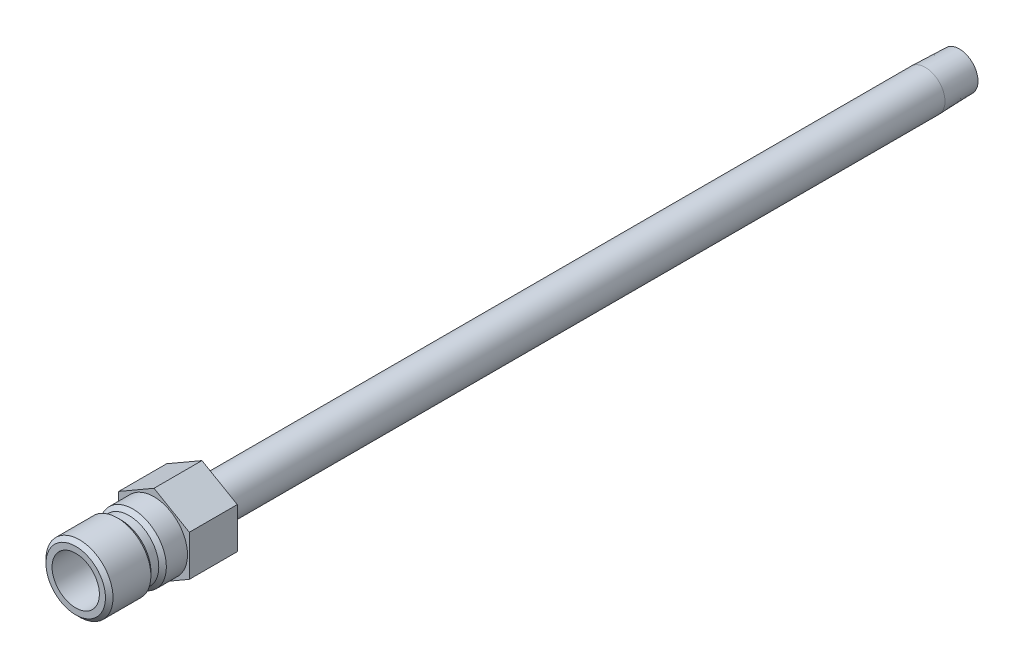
ISO-10303-21;
HEADER;
FILE_DESCRIPTION(('STEP AP214'),'2;1');
FILE_NAME('part.step','',(''),(''),'','','');
FILE_SCHEMA(('AUTOMOTIVE_DESIGN { 1 0 10303 214 1 1 1 1 }'));
ENDSEC;
DATA;
#1=APPLICATION_CONTEXT('core data for automotive mechanical design processes');
#2=APPLICATION_PROTOCOL_DEFINITION('international standard','automotive_design',2000,#1);
#3=PRODUCT_CONTEXT('',#1,'mechanical');
#4=PRODUCT('Part','Part','',(#3));
#5=PRODUCT_RELATED_PRODUCT_CATEGORY('part','',(#4));
#6=PRODUCT_DEFINITION_FORMATION('','',#4);
#7=PRODUCT_DEFINITION_CONTEXT('part definition',#1,'design');
#8=PRODUCT_DEFINITION('design','',#6,#7);
#9=PRODUCT_DEFINITION_SHAPE('','',#8);
#10=(LENGTH_UNIT() NAMED_UNIT(*) SI_UNIT(.MILLI.,.METRE.));
#11=(NAMED_UNIT(*) PLANE_ANGLE_UNIT() SI_UNIT($,.RADIAN.));
#12=(NAMED_UNIT(*) SI_UNIT($,.STERADIAN.) SOLID_ANGLE_UNIT());
#13=UNCERTAINTY_MEASURE_WITH_UNIT(LENGTH_MEASURE(1.E-05),#10,'distance_accuracy_value','');
#14=(GEOMETRIC_REPRESENTATION_CONTEXT(3) GLOBAL_UNCERTAINTY_ASSIGNED_CONTEXT((#13)) GLOBAL_UNIT_ASSIGNED_CONTEXT((#10,
#11,#12)) REPRESENTATION_CONTEXT('',''));
#15=CARTESIAN_POINT('',(0.,0.,0.));
#16=DIRECTION('',(0.,0.,1.));
#17=DIRECTION('',(1.,0.,0.));
#18=AXIS2_PLACEMENT_3D('',#15,#16,#17);
#19=CARTESIAN_POINT('',(0.,0.,-9.652));
#20=DIRECTION('',(0.,0.,-1.));
#21=DIRECTION('',(0.,1.,0.));
#22=AXIS2_PLACEMENT_3D('',#19,#20,#21);
#23=CYLINDRICAL_SURFACE('',#22,2.65430000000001);
#24=CARTESIAN_POINT('',(0.,0.,2.43505017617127));
#25=DIRECTION('',(0.,0.,-1.));
#26=DIRECTION('',(0.,1.,0.));
#27=AXIS2_PLACEMENT_3D('',#24,#25,#26);
#28=CIRCLE('',#27,2.6543);
#29=CARTESIAN_POINT('',(0.,2.6543,2.43505017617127));
#30=VERTEX_POINT('',#29);
#31=EDGE_CURVE('E41',#30,#30,#28,.T.);
#32=ORIENTED_EDGE('',*,*,#31,.F.);
#33=EDGE_LOOP('',(#32));
#34=FACE_BOUND('',#33,.T.);
#35=CARTESIAN_POINT('',(0.,0.,-162.052));
#36=DIRECTION('',(0.,0.,-1.));
#37=DIRECTION('',(0.,1.,0.));
#38=AXIS2_PLACEMENT_3D('',#35,#36,#37);
#39=CIRCLE('',#38,2.65430000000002);
#40=CARTESIAN_POINT('',(0.,2.65430000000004,-162.052));
#41=VERTEX_POINT('',#40);
#42=EDGE_CURVE('E137',#41,#41,#39,.T.);
#43=ORIENTED_EDGE('',*,*,#42,.T.);
#44=EDGE_LOOP('',(#43));
#45=FACE_BOUND('',#44,.T.);
#46=ADVANCED_FACE('F33',(#34,#45),#23,.F.);
#47=CARTESIAN_POINT('',(0.,0.,3.556));
#48=DIRECTION('',(0.,0.,1.));
#49=DIRECTION('',(0.,-1.,0.));
#50=AXIS2_PLACEMENT_3D('',#47,#48,#49);
#51=CONICAL_SURFACE('',#50,4.7625,1.08210413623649);
#52=ORIENTED_EDGE('',*,*,#31,.T.);
#53=EDGE_LOOP('',(#52));
#54=FACE_BOUND('',#53,.T.);
#55=CARTESIAN_POINT('',(0.,0.,3.556));
#56=DIRECTION('',(0.,0.,-1.));
#57=DIRECTION('',(0.,1.,0.));
#58=AXIS2_PLACEMENT_3D('',#55,#56,#57);
#59=CIRCLE('',#58,4.7625);
#60=CARTESIAN_POINT('',(0.,4.7625,3.556));
#61=VERTEX_POINT('',#60);
#62=EDGE_CURVE('E175',#61,#61,#59,.T.);
#63=ORIENTED_EDGE('',*,*,#62,.F.);
#64=EDGE_LOOP('',(#63));
#65=FACE_BOUND('',#64,.T.);
#66=ADVANCED_FACE('F180',(#54,#65),#51,.F.);
#67=CARTESIAN_POINT('',(0.,0.,-9.652));
#68=DIRECTION('',(0.,0.,-1.));
#69=DIRECTION('',(0.,1.,0.));
#70=AXIS2_PLACEMENT_3D('',#67,#68,#69);
#71=CYLINDRICAL_SURFACE('',#70,4.7625);
#72=ORIENTED_EDGE('',*,*,#62,.T.);
#73=EDGE_LOOP('',(#72));
#74=FACE_BOUND('',#73,.T.);
#75=CARTESIAN_POINT('',(0.,0.,15.748));
#76=DIRECTION('',(0.,0.,-1.));
#77=DIRECTION('',(0.,1.,0.));
#78=AXIS2_PLACEMENT_3D('',#75,#76,#77);
#79=CIRCLE('',#78,4.7625);
#80=CARTESIAN_POINT('',(0.,4.7625,15.748));
#81=VERTEX_POINT('',#80);
#82=EDGE_CURVE('E172',#81,#81,#79,.T.);
#83=ORIENTED_EDGE('',*,*,#82,.F.);
#84=EDGE_LOOP('',(#83));
#85=FACE_BOUND('',#84,.T.);
#86=ADVANCED_FACE('F237',(#74,#85),#71,.F.);
#87=CARTESIAN_POINT('',(0.,4.7625,15.748));
#88=DIRECTION('',(0.,0.,1.));
#89=DIRECTION('',(0.,-1.,0.));
#90=AXIS2_PLACEMENT_3D('',#87,#88,#89);
#91=PLANE('',#90);
#92=ORIENTED_EDGE('',*,*,#82,.T.);
#93=EDGE_LOOP('',(#92));
#94=FACE_BOUND('',#93,.T.);
#95=CARTESIAN_POINT('',(0.,0.,15.748));
#96=DIRECTION('',(0.,0.,-1.));
#97=DIRECTION('',(0.,1.,0.));
#98=AXIS2_PLACEMENT_3D('',#95,#96,#97);
#99=CIRCLE('',#98,5.9817);
#100=CARTESIAN_POINT('',(0.,5.9817,15.748));
#101=VERTEX_POINT('',#100);
#102=EDGE_CURVE('E169',#101,#101,#99,.T.);
#103=ORIENTED_EDGE('',*,*,#102,.F.);
#104=EDGE_LOOP('',(#103));
#105=FACE_BOUND('',#104,.T.);
#106=ADVANCED_FACE('F233',(#94,#105),#91,.T.);
#107=CARTESIAN_POINT('',(0.,0.,14.986));
#108=DIRECTION('',(0.,0.,-1.));
#109=DIRECTION('',(0.,1.,0.));
#110=AXIS2_PLACEMENT_3D('',#107,#108,#109);
#111=CONICAL_SURFACE('',#110,6.7437,0.785398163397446);
#112=ORIENTED_EDGE('',*,*,#102,.T.);
#113=EDGE_LOOP('',(#112));
#114=FACE_BOUND('',#113,.T.);
#115=CARTESIAN_POINT('',(0.,0.,14.986));
#116=DIRECTION('',(0.,0.,-1.));
#117=DIRECTION('',(0.,1.,0.));
#118=AXIS2_PLACEMENT_3D('',#115,#116,#117);
#119=CIRCLE('',#118,6.7437);
#120=CARTESIAN_POINT('',(0.,6.7437,14.986));
#121=VERTEX_POINT('',#120);
#122=EDGE_CURVE('E166',#121,#121,#119,.T.);
#123=ORIENTED_EDGE('',*,*,#122,.F.);
#124=EDGE_LOOP('',(#123));
#125=FACE_BOUND('',#124,.T.);
#126=ADVANCED_FACE('F229',(#114,#125),#111,.T.);
#127=CARTESIAN_POINT('',(0.,0.,-9.652));
#128=DIRECTION('',(0.,0.,-1.));
#129=DIRECTION('',(0.,1.,0.));
#130=AXIS2_PLACEMENT_3D('',#127,#128,#129);
#131=CYLINDRICAL_SURFACE('',#130,6.7437);
#132=ORIENTED_EDGE('',*,*,#122,.T.);
#133=EDGE_LOOP('',(#132));
#134=FACE_BOUND('',#133,.T.);
#135=CARTESIAN_POINT('',(0.,0.,7.366));
#136=DIRECTION('',(0.,0.,-1.));
#137=DIRECTION('',(0.,1.,0.));
#138=AXIS2_PLACEMENT_3D('',#135,#136,#137);
#139=CIRCLE('',#138,6.7437);
#140=CARTESIAN_POINT('',(0.,6.7437,7.366));
#141=VERTEX_POINT('',#140);
#142=EDGE_CURVE('E163',#141,#141,#139,.T.);
#143=ORIENTED_EDGE('',*,*,#142,.F.);
#144=EDGE_LOOP('',(#143));
#145=FACE_BOUND('',#144,.T.);
#146=ADVANCED_FACE('F225',(#134,#145),#131,.T.);
#147=CARTESIAN_POINT('',(0.,0.,6.604));
#148=DIRECTION('',(0.,0.,1.));
#149=DIRECTION('',(0.,-1.,0.));
#150=AXIS2_PLACEMENT_3D('',#147,#148,#149);
#151=CONICAL_SURFACE('',#150,5.9817,0.785398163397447);
#152=ORIENTED_EDGE('',*,*,#142,.T.);
#153=EDGE_LOOP('',(#152));
#154=FACE_BOUND('',#153,.T.);
#155=CARTESIAN_POINT('',(0.,0.,6.604));
#156=DIRECTION('',(0.,0.,-1.));
#157=DIRECTION('',(0.,1.,0.));
#158=AXIS2_PLACEMENT_3D('',#155,#156,#157);
#159=CIRCLE('',#158,5.9817);
#160=CARTESIAN_POINT('',(0.,5.9817,6.604));
#161=VERTEX_POINT('',#160);
#162=EDGE_CURVE('E160',#161,#161,#159,.T.);
#163=ORIENTED_EDGE('',*,*,#162,.F.);
#164=EDGE_LOOP('',(#163));
#165=FACE_BOUND('',#164,.T.);
#166=ADVANCED_FACE('F221',(#154,#165),#151,.T.);
#167=CARTESIAN_POINT('',(0.,0.,-9.652));
#168=DIRECTION('',(0.,0.,-1.));
#169=DIRECTION('',(0.,1.,0.));
#170=AXIS2_PLACEMENT_3D('',#167,#168,#169);
#171=CYLINDRICAL_SURFACE('',#170,5.9817);
#172=ORIENTED_EDGE('',*,*,#162,.T.);
#173=EDGE_LOOP('',(#172));
#174=FACE_BOUND('',#173,.T.);
#175=CARTESIAN_POINT('',(0.,0.,5.0165));
#176=DIRECTION('',(0.,0.,-1.));
#177=DIRECTION('',(0.,1.,0.));
#178=AXIS2_PLACEMENT_3D('',#175,#176,#177);
#179=CIRCLE('',#178,5.9817);
#180=CARTESIAN_POINT('',(0.,5.9817,5.0165));
#181=VERTEX_POINT('',#180);
#182=EDGE_CURVE('E157',#181,#181,#179,.T.);
#183=ORIENTED_EDGE('',*,*,#182,.F.);
#184=EDGE_LOOP('',(#183));
#185=FACE_BOUND('',#184,.T.);
#186=ADVANCED_FACE('F217',(#174,#185),#171,.T.);
#187=CARTESIAN_POINT('',(0.,0.,4.25449999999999));
#188=DIRECTION('',(0.,0.,-1.));
#189=DIRECTION('',(0.,1.,0.));
#190=AXIS2_PLACEMENT_3D('',#187,#188,#189);
#191=CONICAL_SURFACE('',#190,6.7437,0.785398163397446);
#192=ORIENTED_EDGE('',*,*,#182,.T.);
#193=EDGE_LOOP('',(#192));
#194=FACE_BOUND('',#193,.T.);
#195=CARTESIAN_POINT('',(0.,0.,4.25449999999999));
#196=DIRECTION('',(0.,0.,-1.));
#197=DIRECTION('',(0.,1.,0.));
#198=AXIS2_PLACEMENT_3D('',#195,#196,#197);
#199=CIRCLE('',#198,6.7437);
#200=CARTESIAN_POINT('',(0.,6.7437,4.25449999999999));
#201=VERTEX_POINT('',#200);
#202=EDGE_CURVE('E154',#201,#201,#199,.T.);
#203=ORIENTED_EDGE('',*,*,#202,.F.);
#204=EDGE_LOOP('',(#203));
#205=FACE_BOUND('',#204,.T.);
#206=ADVANCED_FACE('F213',(#194,#205),#191,.T.);
#207=CARTESIAN_POINT('',(0.,0.,-9.652));
#208=DIRECTION('',(0.,0.,-1.));
#209=DIRECTION('',(0.,1.,0.));
#210=AXIS2_PLACEMENT_3D('',#207,#208,#209);
#211=CYLINDRICAL_SURFACE('',#210,6.7437);
#212=CARTESIAN_POINT('',(0.,0.,0.));
#213=DIRECTION('',(0.,0.,1.));
#214=DIRECTION('',(1.,0.,0.));
#215=AXIS2_PLACEMENT_3D('',#212,#213,#214);
#216=CIRCLE('',#215,6.7437);
#217=CARTESIAN_POINT('',(6.7437,0.,0.));
#218=VERTEX_POINT('',#217);
#219=EDGE_CURVE('E11',#218,#218,#216,.F.);
#220=ORIENTED_EDGE('',*,*,#219,.F.);
#221=EDGE_LOOP('',(#220));
#222=FACE_BOUND('',#221,.T.);
#223=ORIENTED_EDGE('',*,*,#202,.T.);
#224=EDGE_LOOP('',(#223));
#225=FACE_BOUND('',#224,.T.);
#226=ADVANCED_FACE('F209',(#222,#225),#211,.T.);
#227=CARTESIAN_POINT('',(0.,6.7437,-9.652));
#228=DIRECTION('',(0.,0.,-1.));
#229=DIRECTION('',(0.,1.,0.));
#230=AXIS2_PLACEMENT_3D('',#227,#228,#229);
#231=PLANE('',#230);
#232=CARTESIAN_POINT('',(0.,0.,-9.652));
#233=DIRECTION('',(0.,0.,-1.));
#234=DIRECTION('',(0.,1.,0.));
#235=AXIS2_PLACEMENT_3D('',#232,#233,#234);
#236=CIRCLE('',#235,3.96875);
#237=CARTESIAN_POINT('',(0.,3.96875,-9.652));
#238=VERTEX_POINT('',#237);
#239=EDGE_CURVE('E151',#238,#238,#236,.T.);
#240=ORIENTED_EDGE('',*,*,#239,.F.);
#241=EDGE_LOOP('',(#240));
#242=FACE_BOUND('',#241,.T.);
#243=DIRECTION('',(-0.866025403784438,-0.5,0.));
#244=VECTOR('',#243,1.);
#245=CARTESIAN_POINT('',(0.,8.21223022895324,-9.652));
#246=LINE('',#245,#244);
#247=CARTESIAN_POINT('',(0.,8.21223022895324,-9.652));
#248=VERTEX_POINT('',#247);
#249=CARTESIAN_POINT('',(-7.112,4.10611511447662,-9.652));
#250=VERTEX_POINT('',#249);
#251=EDGE_CURVE('E135',#248,#250,#246,.T.);
#252=ORIENTED_EDGE('',*,*,#251,.F.);
#253=DIRECTION('',(-0.866025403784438,0.5,0.));
#254=VECTOR('',#253,1.);
#255=CARTESIAN_POINT('',(7.112,4.10611511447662,-9.652));
#256=LINE('',#255,#254);
#257=CARTESIAN_POINT('',(7.112,4.10611511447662,-9.652));
#258=VERTEX_POINT('',#257);
#259=EDGE_CURVE('E110',#258,#248,#256,.T.);
#260=ORIENTED_EDGE('',*,*,#259,.F.);
#261=DIRECTION('',(0.,1.,0.));
#262=VECTOR('',#261,1.);
#263=CARTESIAN_POINT('',(7.112,-4.10611511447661,-9.652));
#264=LINE('',#263,#262);
#265=CARTESIAN_POINT('',(7.112,-4.10611511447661,-9.652));
#266=VERTEX_POINT('',#265);
#267=EDGE_CURVE('E95',#266,#258,#264,.T.);
#268=ORIENTED_EDGE('',*,*,#267,.F.);
#269=DIRECTION('',(0.866025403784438,0.5,0.));
#270=VECTOR('',#269,1.);
#271=CARTESIAN_POINT('',(0.,-8.21223022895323,-9.652));
#272=LINE('',#271,#270);
#273=CARTESIAN_POINT('',(0.,-8.21223022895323,-9.652));
#274=VERTEX_POINT('',#273);
#275=EDGE_CURVE('E108',#274,#266,#272,.T.);
#276=ORIENTED_EDGE('',*,*,#275,.F.);
#277=DIRECTION('',(0.866025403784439,-0.5,0.));
#278=VECTOR('',#277,1.);
#279=CARTESIAN_POINT('',(-7.112,-4.10611511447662,-9.652));
#280=LINE('',#279,#278);
#281=CARTESIAN_POINT('',(-7.112,-4.10611511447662,-9.652));
#282=VERTEX_POINT('',#281);
#283=EDGE_CURVE('E113',#282,#274,#280,.T.);
#284=ORIENTED_EDGE('',*,*,#283,.F.);
#285=DIRECTION('',(0.,-1.,0.));
#286=VECTOR('',#285,1.);
#287=CARTESIAN_POINT('',(-7.112,4.10611511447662,-9.652));
#288=LINE('',#287,#286);
#289=EDGE_CURVE('E115',#250,#282,#288,.T.);
#290=ORIENTED_EDGE('',*,*,#289,.F.);
#291=EDGE_LOOP('',(#252,#260,#268,#276,#284,#290));
#292=FACE_BOUND('',#291,.T.);
#293=ADVANCED_FACE('F106',(#242,#292),#231,.T.);
#294=CARTESIAN_POINT('',(0.,0.,-9.652));
#295=DIRECTION('',(0.,0.,-1.));
#296=DIRECTION('',(0.,1.,0.));
#297=AXIS2_PLACEMENT_3D('',#294,#295,#296);
#298=CYLINDRICAL_SURFACE('',#297,3.96874999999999);
#299=ORIENTED_EDGE('',*,*,#239,.T.);
#300=EDGE_LOOP('',(#299));
#301=FACE_BOUND('',#300,.T.);
#302=CARTESIAN_POINT('',(0.,0.,-155.194));
#303=DIRECTION('',(0.,0.,-1.));
#304=DIRECTION('',(0.,1.,0.));
#305=AXIS2_PLACEMENT_3D('',#302,#303,#304);
#306=CIRCLE('',#305,3.96874999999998);
#307=CARTESIAN_POINT('',(0.,3.96875,-155.194));
#308=VERTEX_POINT('',#307);
#309=EDGE_CURVE('E148',#308,#308,#306,.T.);
#310=ORIENTED_EDGE('',*,*,#309,.F.);
#311=EDGE_LOOP('',(#310));
#312=FACE_BOUND('',#311,.T.);
#313=ADVANCED_FACE('F199',(#301,#312),#298,.T.);
#314=CARTESIAN_POINT('',(0.,0.,-162.052));
#315=DIRECTION('',(0.,0.,1.));
#316=DIRECTION('',(0.,-1.,0.));
#317=AXIS2_PLACEMENT_3D('',#314,#315,#316);
#318=CONICAL_SURFACE('',#317,3.75443877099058,0.0312396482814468);
#319=ORIENTED_EDGE('',*,*,#309,.T.);
#320=EDGE_LOOP('',(#319));
#321=FACE_BOUND('',#320,.T.);
#322=CARTESIAN_POINT('',(0.,0.,-162.052));
#323=DIRECTION('',(0.,0.,-1.));
#324=DIRECTION('',(0.,1.,0.));
#325=AXIS2_PLACEMENT_3D('',#322,#323,#324);
#326=CIRCLE('',#325,3.75443877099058);
#327=CARTESIAN_POINT('',(0.,3.7544387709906,-162.052));
#328=VERTEX_POINT('',#327);
#329=EDGE_CURVE('E145',#328,#328,#326,.T.);
#330=ORIENTED_EDGE('',*,*,#329,.F.);
#331=EDGE_LOOP('',(#330));
#332=FACE_BOUND('',#331,.T.);
#333=ADVANCED_FACE('F190',(#321,#332),#318,.T.);
#334=CARTESIAN_POINT('',(0.,3.7544387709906,-162.052));
#335=DIRECTION('',(0.,0.,-1.));
#336=DIRECTION('',(0.,1.,0.));
#337=AXIS2_PLACEMENT_3D('',#334,#335,#336);
#338=PLANE('',#337);
#339=ORIENTED_EDGE('',*,*,#329,.T.);
#340=EDGE_LOOP('',(#339));
#341=FACE_BOUND('',#340,.T.);
#342=ORIENTED_EDGE('',*,*,#42,.F.);
#343=EDGE_LOOP('',(#342));
#344=FACE_BOUND('',#343,.T.);
#345=ADVANCED_FACE('F187',(#341,#344),#338,.T.);
#346=CARTESIAN_POINT('',(0.,8.21223022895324,-9.652));
#347=DIRECTION('',(-0.5,0.866025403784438,0.));
#348=DIRECTION('',(-0.866025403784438,-0.5,0.));
#349=AXIS2_PLACEMENT_3D('',#346,#347,#348);
#350=PLANE('',#349);
#351=DIRECTION('',(-0.866025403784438,-0.5,0.));
#352=VECTOR('',#351,1.);
#353=CARTESIAN_POINT('',(0.,8.21223022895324,0.));
#354=LINE('',#353,#352);
#355=CARTESIAN_POINT('',(0.,8.21223022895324,0.));
#356=VERTEX_POINT('',#355);
#357=CARTESIAN_POINT('',(-7.112,4.10611511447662,0.));
#358=VERTEX_POINT('',#357);
#359=EDGE_CURVE('E120',#356,#358,#354,.T.);
#360=ORIENTED_EDGE('',*,*,#359,.F.);
#361=DIRECTION('',(0.,0.,1.));
#362=VECTOR('',#361,1.);
#363=CARTESIAN_POINT('',(0.,8.21223022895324,-9.652));
#364=LINE('',#363,#362);
#365=EDGE_CURVE('E49',#248,#356,#364,.T.);
#366=ORIENTED_EDGE('',*,*,#365,.F.);
#367=ORIENTED_EDGE('',*,*,#251,.T.);
#368=DIRECTION('',(0.,0.,1.));
#369=VECTOR('',#368,1.);
#370=CARTESIAN_POINT('',(-7.112,4.10611511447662,-9.652));
#371=LINE('',#370,#369);
#372=EDGE_CURVE('E84',#250,#358,#371,.T.);
#373=ORIENTED_EDGE('',*,*,#372,.T.);
#374=EDGE_LOOP('',(#360,#366,#367,#373));
#375=FACE_BOUND('',#374,.T.);
#376=ADVANCED_FACE('F189',(#375),#350,.T.);
#377=CARTESIAN_POINT('',(7.112,4.10611511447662,-9.652));
#378=DIRECTION('',(0.5,0.866025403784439,0.));
#379=DIRECTION('',(-0.866025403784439,0.5,0.));
#380=AXIS2_PLACEMENT_3D('',#377,#378,#379);
#381=PLANE('',#380);
#382=DIRECTION('',(-0.866025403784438,0.5,0.));
#383=VECTOR('',#382,1.);
#384=CARTESIAN_POINT('',(7.112,4.10611511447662,0.));
#385=LINE('',#384,#383);
#386=CARTESIAN_POINT('',(7.112,4.10611511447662,0.));
#387=VERTEX_POINT('',#386);
#388=EDGE_CURVE('E132',#387,#356,#385,.T.);
#389=ORIENTED_EDGE('',*,*,#388,.F.);
#390=DIRECTION('',(0.,0.,1.));
#391=VECTOR('',#390,1.);
#392=CARTESIAN_POINT('',(7.112,4.10611511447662,-9.652));
#393=LINE('',#392,#391);
#394=EDGE_CURVE('E72',#258,#387,#393,.T.);
#395=ORIENTED_EDGE('',*,*,#394,.F.);
#396=ORIENTED_EDGE('',*,*,#259,.T.);
#397=ORIENTED_EDGE('',*,*,#365,.T.);
#398=EDGE_LOOP('',(#389,#395,#396,#397));
#399=FACE_BOUND('',#398,.T.);
#400=ADVANCED_FACE('F197',(#399),#381,.T.);
#401=CARTESIAN_POINT('',(7.112,-4.10611511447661,-9.652));
#402=DIRECTION('',(1.,0.,0.));
#403=DIRECTION('',(0.,1.,0.));
#404=AXIS2_PLACEMENT_3D('',#401,#402,#403);
#405=PLANE('',#404);
#406=DIRECTION('',(0.,1.,0.));
#407=VECTOR('',#406,1.);
#408=CARTESIAN_POINT('',(7.112,-4.10611511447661,0.));
#409=LINE('',#408,#407);
#410=CARTESIAN_POINT('',(7.112,-4.10611511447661,0.));
#411=VERTEX_POINT('',#410);
#412=EDGE_CURVE('E97',#411,#387,#409,.T.);
#413=ORIENTED_EDGE('',*,*,#412,.F.);
#414=DIRECTION('',(0.,0.,1.));
#415=VECTOR('',#414,1.);
#416=CARTESIAN_POINT('',(7.112,-4.10611511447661,-9.652));
#417=LINE('',#416,#415);
#418=EDGE_CURVE('E92',#266,#411,#417,.T.);
#419=ORIENTED_EDGE('',*,*,#418,.F.);
#420=ORIENTED_EDGE('',*,*,#267,.T.);
#421=ORIENTED_EDGE('',*,*,#394,.T.);
#422=EDGE_LOOP('',(#413,#419,#420,#421));
#423=FACE_BOUND('',#422,.T.);
#424=ADVANCED_FACE('F94',(#423),#405,.T.);
#425=CARTESIAN_POINT('',(0.,-8.21223022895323,-9.652));
#426=DIRECTION('',(0.5,-0.866025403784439,0.));
#427=DIRECTION('',(0.866025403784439,0.5,0.));
#428=AXIS2_PLACEMENT_3D('',#425,#426,#427);
#429=PLANE('',#428);
#430=DIRECTION('',(0.866025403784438,0.5,0.));
#431=VECTOR('',#430,1.);
#432=CARTESIAN_POINT('',(0.,-8.21223022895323,0.));
#433=LINE('',#432,#431);
#434=CARTESIAN_POINT('',(0.,-8.21223022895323,0.));
#435=VERTEX_POINT('',#434);
#436=EDGE_CURVE('E129',#435,#411,#433,.T.);
#437=ORIENTED_EDGE('',*,*,#436,.F.);
#438=DIRECTION('',(0.,0.,1.));
#439=VECTOR('',#438,1.);
#440=CARTESIAN_POINT('',(0.,-8.21223022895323,-9.652));
#441=LINE('',#440,#439);
#442=EDGE_CURVE('E102',#274,#435,#441,.T.);
#443=ORIENTED_EDGE('',*,*,#442,.F.);
#444=ORIENTED_EDGE('',*,*,#275,.T.);
#445=ORIENTED_EDGE('',*,*,#418,.T.);
#446=EDGE_LOOP('',(#437,#443,#444,#445));
#447=FACE_BOUND('',#446,.T.);
#448=ADVANCED_FACE('F112',(#447),#429,.T.);
#449=CARTESIAN_POINT('',(-7.112,-4.10611511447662,-9.652));
#450=DIRECTION('',(-0.5,-0.866025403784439,0.));
#451=DIRECTION('',(0.866025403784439,-0.5,0.));
#452=AXIS2_PLACEMENT_3D('',#449,#450,#451);
#453=PLANE('',#452);
#454=DIRECTION('',(0.866025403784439,-0.5,0.));
#455=VECTOR('',#454,1.);
#456=CARTESIAN_POINT('',(-7.112,-4.10611511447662,0.));
#457=LINE('',#456,#455);
#458=CARTESIAN_POINT('',(-7.112,-4.10611511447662,0.));
#459=VERTEX_POINT('',#458);
#460=EDGE_CURVE('E126',#459,#435,#457,.T.);
#461=ORIENTED_EDGE('',*,*,#460,.F.);
#462=DIRECTION('',(0.,0.,1.));
#463=VECTOR('',#462,1.);
#464=CARTESIAN_POINT('',(-7.112,-4.10611511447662,-9.652));
#465=LINE('',#464,#463);
#466=EDGE_CURVE('E140',#282,#459,#465,.T.);
#467=ORIENTED_EDGE('',*,*,#466,.F.);
#468=ORIENTED_EDGE('',*,*,#283,.T.);
#469=ORIENTED_EDGE('',*,*,#442,.T.);
#470=EDGE_LOOP('',(#461,#467,#468,#469));
#471=FACE_BOUND('',#470,.T.);
#472=ADVANCED_FACE('F352',(#471),#453,.T.);
#473=CARTESIAN_POINT('',(-7.112,4.10611511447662,-9.652));
#474=DIRECTION('',(-1.,0.,0.));
#475=DIRECTION('',(0.,-1.,0.));
#476=AXIS2_PLACEMENT_3D('',#473,#474,#475);
#477=PLANE('',#476);
#478=DIRECTION('',(0.,-1.,0.));
#479=VECTOR('',#478,1.);
#480=CARTESIAN_POINT('',(-7.112,4.10611511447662,0.));
#481=LINE('',#480,#479);
#482=EDGE_CURVE('E123',#358,#459,#481,.T.);
#483=ORIENTED_EDGE('',*,*,#482,.F.);
#484=ORIENTED_EDGE('',*,*,#372,.F.);
#485=ORIENTED_EDGE('',*,*,#289,.T.);
#486=ORIENTED_EDGE('',*,*,#466,.T.);
#487=EDGE_LOOP('',(#483,#484,#485,#486));
#488=FACE_BOUND('',#487,.T.);
#489=ADVANCED_FACE('F360',(#488),#477,.T.);
#490=CARTESIAN_POINT('',(-7.112,4.10611511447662,0.));
#491=DIRECTION('',(0.,0.,1.));
#492=DIRECTION('',(1.,0.,0.));
#493=AXIS2_PLACEMENT_3D('',#490,#491,#492);
#494=PLANE('',#493);
#495=ORIENTED_EDGE('',*,*,#219,.T.);
#496=EDGE_LOOP('',(#495));
#497=FACE_BOUND('',#496,.T.);
#498=ORIENTED_EDGE('',*,*,#359,.T.);
#499=ORIENTED_EDGE('',*,*,#482,.T.);
#500=ORIENTED_EDGE('',*,*,#460,.T.);
#501=ORIENTED_EDGE('',*,*,#436,.T.);
#502=ORIENTED_EDGE('',*,*,#412,.T.);
#503=ORIENTED_EDGE('',*,*,#388,.T.);
#504=EDGE_LOOP('',(#498,#499,#500,#501,#502,#503));
#505=FACE_BOUND('',#504,.T.);
#506=ADVANCED_FACE('F369',(#497,#505),#494,.T.);
#507=CLOSED_SHELL('',(#46,#66,#86,#106,#126,#146,#166,#186,#206,#226,#293,#313,#333,#345,#376,
#400,#424,#448,#472,#489,#506));
#508=MANIFOLD_SOLID_BREP('B2',#507);
#509=ADVANCED_BREP_SHAPE_REPRESENTATION('',(#18,#508),#14);
#510=SHAPE_DEFINITION_REPRESENTATION(#9,#509);
ENDSEC;
END-ISO-10303-21;
